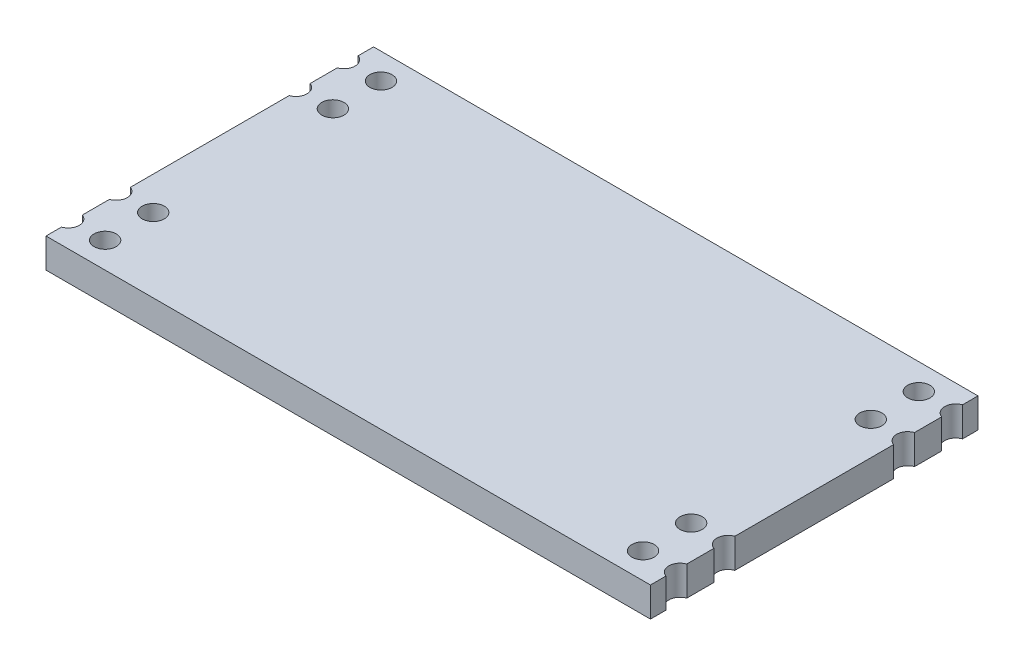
from build123d import *

# Parameters (mm, degrees)
SKETCH1_W                       = 32.7
SKETCH1_H                       = 17.72
MAIN_BODY_DEPTH                 = 1.6
SKETCH2_R                       = 0.6
SOLDERED_CONNECTION_HOLES_DEPTH = 19.664996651
LPATTERN1_COUNT                 = 2
LPATTERN1_PITCH                 = 2
MIRROR1_COPY_1_SKETCH_R         = 0.6
MIRROR1_COPY_1_DEPTH            = 19.664996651
MIRROR2_COPY_1_SKETCH_R         = 0.6
MIRROR2_COPY_1_DEPTH            = 19.664996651
MIRROR2_COPY_2_SKETCH_R         = 0.6
MIRROR2_COPY_2_DEPTH            = 19.664996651
MIRROR2_COPY_3_SKETCH_R         = 0.6
MIRROR2_COPY_3_DEPTH            = 19.664996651


with BuildPart() as part:
    # Sketch1 → MAIN BODY (new body)
    with BuildSketch(Plane(origin=(0, 0, 0), x_dir=(1, 0, 0), z_dir=(0, 1, 0))):
        Rectangle(SKETCH1_W, SKETCH1_H)
    extrude(amount=MAIN_BODY_DEPTH)

    # Sketch2 → SOLDERED CONNECTION HOLES (cut, through all)
    with BuildSketch(Plane(origin=(0, 1.6, 0), x_dir=(1, 0, 0), z_dir=(0, 1, 0))):
        with Locations(Location((-14.55, 7.46, 0), (0, 0, 270))):
            Circle(SKETCH2_R)
        with Locations(Location((-14.55, 4.86, 0), (0, 0, 270))):
            Circle(SKETCH2_R)
    soldered_connection_holes = extrude(amount=-SOLDERED_CONNECTION_HOLES_DEPTH, mode=Mode.SUBTRACT)

    # LPattern1: SOLDERED CONNECTION HOLES ×2
    with Locations(*[(-i * LPATTERN1_PITCH, 0, 0) for i in range(1, LPATTERN1_COUNT)]):
        add(soldered_connection_holes, mode=Mode.SUBTRACT)

    # Mirror1: SOLDERED CONNECTION HOLES across plane
    add(soldered_connection_holes.mirror(Plane(origin=(0, 0, 0), x_dir=(0, 0, 1), z_dir=(1, 0, 0))), mode=Mode.SUBTRACT)

    # Mirror1 copy 1 sketch → Mirror1 copy 1 (cut, through all)
    with BuildSketch(Plane(origin=(2, 1.6, 0), x_dir=(-1, 0, 0), z_dir=(0, 1, 0))):
        with Locations((-14.55, -7.46)):
            Circle(MIRROR1_COPY_1_SKETCH_R)
        with Locations((-14.55, -4.86)):
            Circle(MIRROR1_COPY_1_SKETCH_R)
    extrude(amount=-MIRROR1_COPY_1_DEPTH, mode=Mode.SUBTRACT)

    # Mirror2: SOLDERED CONNECTION HOLES across plane
    add(soldered_connection_holes.mirror(Plane.XY), mode=Mode.SUBTRACT)

    # Mirror2 copy 1 sketch → Mirror2 copy 1 (cut, through all)
    with BuildSketch(Plane(origin=(-2, 1.6, 0), x_dir=(1, 0, 0), z_dir=(0, 1, 0))):
        with Locations((-14.55, -7.46)):
            Circle(MIRROR2_COPY_1_SKETCH_R)
        with Locations((-14.55, -4.86)):
            Circle(MIRROR2_COPY_1_SKETCH_R)
    extrude(amount=-MIRROR2_COPY_1_DEPTH, mode=Mode.SUBTRACT)

    # Mirror2 copy 2 sketch → Mirror2 copy 2 (cut, through all)
    with BuildSketch(Plane(origin=(0, 1.6, 0), x_dir=(-1, 0, 0), z_dir=(0, 1, 0))):
        with Locations(Location((-14.55, 7.46, 0), (0, 0, 270))):
            Circle(MIRROR2_COPY_2_SKETCH_R)
        with Locations(Location((-14.55, 4.86, 0), (0, 0, 270))):
            Circle(MIRROR2_COPY_2_SKETCH_R)
    extrude(amount=-MIRROR2_COPY_2_DEPTH, mode=Mode.SUBTRACT)

    # Mirror2 copy 3 sketch → Mirror2 copy 3 (cut, through all)
    with BuildSketch(Plane(origin=(2, 1.6, 0), x_dir=(-1, 0, 0), z_dir=(0, 1, 0))):
        with Locations(Location((-14.55, 7.46, 0), (0, 0, 270))):
            Circle(MIRROR2_COPY_3_SKETCH_R)
        with Locations(Location((-14.55, 4.86, 0), (0, 0, 270))):
            Circle(MIRROR2_COPY_3_SKETCH_R)
    extrude(amount=-MIRROR2_COPY_3_DEPTH, mode=Mode.SUBTRACT)


solid = part.part
